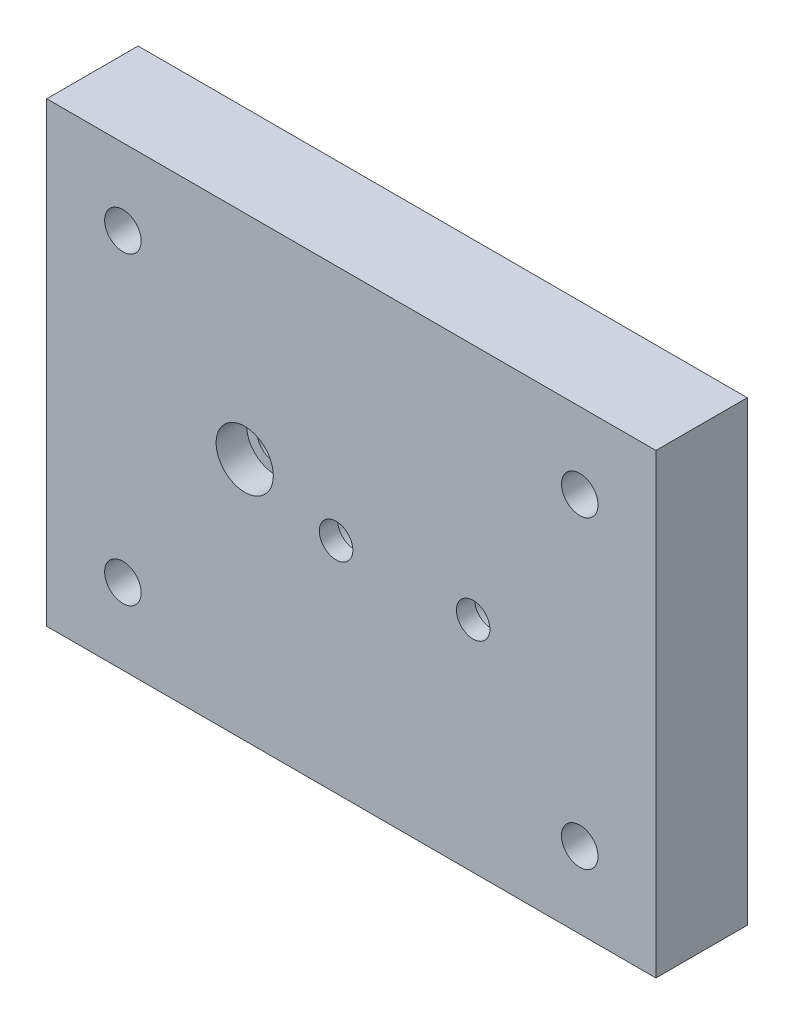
ISO-10303-21;
HEADER;
FILE_DESCRIPTION(('STEP AP214'),'2;1');
FILE_NAME('part.step','',(''),(''),'','','');
FILE_SCHEMA(('AUTOMOTIVE_DESIGN { 1 0 10303 214 1 1 1 1 }'));
ENDSEC;
DATA;
#1=APPLICATION_CONTEXT('core data for automotive mechanical design processes');
#2=APPLICATION_PROTOCOL_DEFINITION('international standard','automotive_design',2000,#1);
#3=PRODUCT_CONTEXT('',#1,'mechanical');
#4=PRODUCT('Part','Part','',(#3));
#5=PRODUCT_RELATED_PRODUCT_CATEGORY('part','',(#4));
#6=PRODUCT_DEFINITION_FORMATION('','',#4);
#7=PRODUCT_DEFINITION_CONTEXT('part definition',#1,'design');
#8=PRODUCT_DEFINITION('design','',#6,#7);
#9=PRODUCT_DEFINITION_SHAPE('','',#8);
#10=(LENGTH_UNIT() NAMED_UNIT(*) SI_UNIT(.MILLI.,.METRE.));
#11=(NAMED_UNIT(*) PLANE_ANGLE_UNIT() SI_UNIT($,.RADIAN.));
#12=(NAMED_UNIT(*) SI_UNIT($,.STERADIAN.) SOLID_ANGLE_UNIT());
#13=UNCERTAINTY_MEASURE_WITH_UNIT(LENGTH_MEASURE(1.E-05),#10,'distance_accuracy_value','');
#14=(GEOMETRIC_REPRESENTATION_CONTEXT(3) GLOBAL_UNCERTAINTY_ASSIGNED_CONTEXT((#13)) GLOBAL_UNIT_ASSIGNED_CONTEXT((#10,
#11,#12)) REPRESENTATION_CONTEXT('',''));
#15=CARTESIAN_POINT('',(0.,0.,0.));
#16=DIRECTION('',(0.,0.,1.));
#17=DIRECTION('',(1.,0.,0.));
#18=AXIS2_PLACEMENT_3D('',#15,#16,#17);
#19=CARTESIAN_POINT('',(0.,0.,30.));
#20=DIRECTION('',(1.,0.,0.));
#21=DIRECTION('',(0.,0.,-1.));
#22=AXIS2_PLACEMENT_3D('',#19,#20,#21);
#23=PLANE('',#22);
#24=DIRECTION('',(0.,-1.,0.));
#25=VECTOR('',#24,1.);
#26=CARTESIAN_POINT('',(0.,0.,0.));
#27=LINE('',#26,#25);
#28=CARTESIAN_POINT('',(0.,150.,0.));
#29=VERTEX_POINT('',#28);
#30=CARTESIAN_POINT('',(0.,0.,0.));
#31=VERTEX_POINT('',#30);
#32=EDGE_CURVE('E72',#29,#31,#27,.T.);
#33=ORIENTED_EDGE('',*,*,#32,.T.);
#34=DIRECTION('',(0.,0.,-1.));
#35=VECTOR('',#34,1.);
#36=CARTESIAN_POINT('',(0.,0.,30.));
#37=LINE('',#36,#35);
#38=CARTESIAN_POINT('',(0.,0.,30.));
#39=VERTEX_POINT('',#38);
#40=EDGE_CURVE('E11',#39,#31,#37,.T.);
#41=ORIENTED_EDGE('',*,*,#40,.F.);
#42=DIRECTION('',(0.,-1.,0.));
#43=VECTOR('',#42,1.);
#44=CARTESIAN_POINT('',(0.,0.,30.));
#45=LINE('',#44,#43);
#46=CARTESIAN_POINT('',(0.,150.,30.));
#47=VERTEX_POINT('',#46);
#48=EDGE_CURVE('E95',#47,#39,#45,.T.);
#49=ORIENTED_EDGE('',*,*,#48,.F.);
#50=DIRECTION('',(0.,0.,-1.));
#51=VECTOR('',#50,1.);
#52=CARTESIAN_POINT('',(0.,150.,30.));
#53=LINE('',#52,#51);
#54=EDGE_CURVE('E84',#47,#29,#53,.T.);
#55=ORIENTED_EDGE('',*,*,#54,.T.);
#56=EDGE_LOOP('',(#33,#41,#49,#55));
#57=FACE_BOUND('',#56,.T.);
#58=ADVANCED_FACE('F28',(#57),#23,.F.);
#59=CARTESIAN_POINT('',(0.,0.,30.));
#60=DIRECTION('',(0.,1.,0.));
#61=DIRECTION('',(0.,0.,1.));
#62=AXIS2_PLACEMENT_3D('',#59,#60,#61);
#63=PLANE('',#62);
#64=DIRECTION('',(1.,0.,0.));
#65=VECTOR('',#64,1.);
#66=CARTESIAN_POINT('',(0.,0.,0.));
#67=LINE('',#66,#65);
#68=CARTESIAN_POINT('',(200.,0.,0.));
#69=VERTEX_POINT('',#68);
#70=EDGE_CURVE('E68',#31,#69,#67,.T.);
#71=ORIENTED_EDGE('',*,*,#70,.T.);
#72=DIRECTION('',(0.,0.,-1.));
#73=VECTOR('',#72,1.);
#74=CARTESIAN_POINT('',(200.,0.,30.));
#75=LINE('',#74,#73);
#76=CARTESIAN_POINT('',(200.,0.,30.));
#77=VERTEX_POINT('',#76);
#78=EDGE_CURVE('E35',#77,#69,#75,.T.);
#79=ORIENTED_EDGE('',*,*,#78,.F.);
#80=DIRECTION('',(1.,0.,0.));
#81=VECTOR('',#80,1.);
#82=CARTESIAN_POINT('',(0.,0.,30.));
#83=LINE('',#82,#81);
#84=EDGE_CURVE('E80',#39,#77,#83,.T.);
#85=ORIENTED_EDGE('',*,*,#84,.F.);
#86=ORIENTED_EDGE('',*,*,#40,.T.);
#87=EDGE_LOOP('',(#71,#79,#85,#86));
#88=FACE_BOUND('',#87,.T.);
#89=ADVANCED_FACE('F79',(#88),#63,.F.);
#90=CARTESIAN_POINT('',(200.,0.,30.));
#91=DIRECTION('',(-1.,0.,0.));
#92=DIRECTION('',(0.,0.,1.));
#93=AXIS2_PLACEMENT_3D('',#90,#91,#92);
#94=PLANE('',#93);
#95=DIRECTION('',(0.,1.,0.));
#96=VECTOR('',#95,1.);
#97=CARTESIAN_POINT('',(200.,0.,0.));
#98=LINE('',#97,#96);
#99=CARTESIAN_POINT('',(200.,150.,0.));
#100=VERTEX_POINT('',#99);
#101=EDGE_CURVE('E73',#69,#100,#98,.T.);
#102=ORIENTED_EDGE('',*,*,#101,.T.);
#103=DIRECTION('',(0.,0.,-1.));
#104=VECTOR('',#103,1.);
#105=CARTESIAN_POINT('',(200.,150.,30.));
#106=LINE('',#105,#104);
#107=CARTESIAN_POINT('',(200.,150.,30.));
#108=VERTEX_POINT('',#107);
#109=EDGE_CURVE('E101',#108,#100,#106,.T.);
#110=ORIENTED_EDGE('',*,*,#109,.F.);
#111=DIRECTION('',(0.,1.,0.));
#112=VECTOR('',#111,1.);
#113=CARTESIAN_POINT('',(200.,0.,30.));
#114=LINE('',#113,#112);
#115=EDGE_CURVE('E47',#77,#108,#114,.T.);
#116=ORIENTED_EDGE('',*,*,#115,.F.);
#117=ORIENTED_EDGE('',*,*,#78,.T.);
#118=EDGE_LOOP('',(#102,#110,#116,#117));
#119=FACE_BOUND('',#118,.T.);
#120=ADVANCED_FACE('F104',(#119),#94,.F.);
#121=CARTESIAN_POINT('',(0.,150.,30.));
#122=DIRECTION('',(0.,-1.,0.));
#123=DIRECTION('',(0.,0.,-1.));
#124=AXIS2_PLACEMENT_3D('',#121,#122,#123);
#125=PLANE('',#124);
#126=DIRECTION('',(-1.,0.,0.));
#127=VECTOR('',#126,1.);
#128=CARTESIAN_POINT('',(0.,150.,0.));
#129=LINE('',#128,#127);
#130=EDGE_CURVE('E93',#100,#29,#129,.T.);
#131=ORIENTED_EDGE('',*,*,#130,.T.);
#132=ORIENTED_EDGE('',*,*,#54,.F.);
#133=DIRECTION('',(-1.,0.,0.));
#134=VECTOR('',#133,1.);
#135=CARTESIAN_POINT('',(0.,150.,30.));
#136=LINE('',#135,#134);
#137=EDGE_CURVE('E42',#108,#47,#136,.T.);
#138=ORIENTED_EDGE('',*,*,#137,.F.);
#139=ORIENTED_EDGE('',*,*,#109,.T.);
#140=EDGE_LOOP('',(#131,#132,#138,#139));
#141=FACE_BOUND('',#140,.T.);
#142=ADVANCED_FACE('F106',(#141),#125,.F.);
#143=CARTESIAN_POINT('',(0.,150.,30.));
#144=DIRECTION('',(0.,0.,-1.));
#145=DIRECTION('',(-1.,0.,0.));
#146=AXIS2_PLACEMENT_3D('',#143,#144,#145);
#147=PLANE('',#146);
#148=CARTESIAN_POINT('',(175.,125.,30.));
#149=DIRECTION('',(0.,0.,1.));
#150=DIRECTION('',(1.,0.,0.));
#151=AXIS2_PLACEMENT_3D('',#148,#149,#150);
#152=CIRCLE('',#151,6.00000000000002);
#153=CARTESIAN_POINT('',(181.,125.,30.));
#154=VERTEX_POINT('',#153);
#155=EDGE_CURVE('E419',#154,#154,#152,.T.);
#156=ORIENTED_EDGE('',*,*,#155,.F.);
#157=EDGE_LOOP('',(#156));
#158=FACE_BOUND('',#157,.T.);
#159=CARTESIAN_POINT('',(175.,25.,30.));
#160=DIRECTION('',(0.,0.,1.));
#161=DIRECTION('',(1.,0.,0.));
#162=AXIS2_PLACEMENT_3D('',#159,#160,#161);
#163=CIRCLE('',#162,6.00000000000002);
#164=CARTESIAN_POINT('',(181.,25.,30.));
#165=VERTEX_POINT('',#164);
#166=EDGE_CURVE('E422',#165,#165,#163,.T.);
#167=ORIENTED_EDGE('',*,*,#166,.F.);
#168=EDGE_LOOP('',(#167));
#169=FACE_BOUND('',#168,.T.);
#170=CARTESIAN_POINT('',(25.,25.,30.));
#171=DIRECTION('',(0.,0.,1.));
#172=DIRECTION('',(1.,0.,0.));
#173=AXIS2_PLACEMENT_3D('',#170,#171,#172);
#174=CIRCLE('',#173,6.);
#175=CARTESIAN_POINT('',(31.,25.,30.));
#176=VERTEX_POINT('',#175);
#177=EDGE_CURVE('E425',#176,#176,#174,.T.);
#178=ORIENTED_EDGE('',*,*,#177,.F.);
#179=EDGE_LOOP('',(#178));
#180=FACE_BOUND('',#179,.T.);
#181=CARTESIAN_POINT('',(25.,125.,30.));
#182=DIRECTION('',(0.,0.,1.));
#183=DIRECTION('',(1.,0.,0.));
#184=AXIS2_PLACEMENT_3D('',#181,#182,#183);
#185=CIRCLE('',#184,6.);
#186=CARTESIAN_POINT('',(31.,125.,30.));
#187=VERTEX_POINT('',#186);
#188=EDGE_CURVE('E428',#187,#187,#185,.T.);
#189=ORIENTED_EDGE('',*,*,#188,.F.);
#190=EDGE_LOOP('',(#189));
#191=FACE_BOUND('',#190,.T.);
#192=CARTESIAN_POINT('',(140.,71.88,30.));
#193=DIRECTION('',(0.,0.,1.));
#194=DIRECTION('',(1.,0.,0.));
#195=AXIS2_PLACEMENT_3D('',#192,#193,#194);
#196=CIRCLE('',#195,5.50000000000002);
#197=CARTESIAN_POINT('',(145.5,71.88,30.));
#198=VERTEX_POINT('',#197);
#199=EDGE_CURVE('E449',#198,#198,#196,.T.);
#200=ORIENTED_EDGE('',*,*,#199,.F.);
#201=EDGE_LOOP('',(#200));
#202=FACE_BOUND('',#201,.T.);
#203=CARTESIAN_POINT('',(95.,71.88,30.));
#204=DIRECTION('',(0.,0.,1.));
#205=DIRECTION('',(1.,0.,0.));
#206=AXIS2_PLACEMENT_3D('',#203,#204,#205);
#207=CIRCLE('',#206,5.5);
#208=CARTESIAN_POINT('',(100.5,71.88,30.));
#209=VERTEX_POINT('',#208);
#210=EDGE_CURVE('E452',#209,#209,#207,.T.);
#211=ORIENTED_EDGE('',*,*,#210,.F.);
#212=EDGE_LOOP('',(#211));
#213=FACE_BOUND('',#212,.T.);
#214=CARTESIAN_POINT('',(65.,80.,30.));
#215=DIRECTION('',(0.,0.,1.));
#216=DIRECTION('',(1.,0.,0.));
#217=AXIS2_PLACEMENT_3D('',#214,#215,#216);
#218=CIRCLE('',#217,9.38999999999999);
#219=CARTESIAN_POINT('',(74.39,80.,30.));
#220=VERTEX_POINT('',#219);
#221=EDGE_CURVE('E88',#220,#220,#218,.T.);
#222=ORIENTED_EDGE('',*,*,#221,.F.);
#223=EDGE_LOOP('',(#222));
#224=FACE_BOUND('',#223,.T.);
#225=ORIENTED_EDGE('',*,*,#48,.T.);
#226=ORIENTED_EDGE('',*,*,#84,.T.);
#227=ORIENTED_EDGE('',*,*,#115,.T.);
#228=ORIENTED_EDGE('',*,*,#137,.T.);
#229=EDGE_LOOP('',(#225,#226,#227,#228));
#230=FACE_BOUND('',#229,.T.);
#231=ADVANCED_FACE('F107',(#158,#169,#180,#191,#202,#213,#224,#230),#147,.F.);
#232=CARTESIAN_POINT('',(0.,150.,0.));
#233=DIRECTION('',(0.,0.,-1.));
#234=DIRECTION('',(-1.,0.,0.));
#235=AXIS2_PLACEMENT_3D('',#232,#233,#234);
#236=PLANE('',#235);
#237=CARTESIAN_POINT('',(25.,25.,0.));
#238=DIRECTION('',(0.,0.,1.));
#239=DIRECTION('',(1.,0.,0.));
#240=AXIS2_PLACEMENT_3D('',#237,#238,#239);
#241=CIRCLE('',#240,9.);
#242=CARTESIAN_POINT('',(34.,25.,0.));
#243=VERTEX_POINT('',#242);
#244=EDGE_CURVE('E382',#243,#243,#241,.T.);
#245=ORIENTED_EDGE('',*,*,#244,.T.);
#246=EDGE_LOOP('',(#245));
#247=FACE_BOUND('',#246,.T.);
#248=CARTESIAN_POINT('',(175.,25.,0.));
#249=DIRECTION('',(0.,0.,1.));
#250=DIRECTION('',(1.,0.,0.));
#251=AXIS2_PLACEMENT_3D('',#248,#249,#250);
#252=CIRCLE('',#251,9.00000000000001);
#253=CARTESIAN_POINT('',(184.,25.,0.));
#254=VERTEX_POINT('',#253);
#255=EDGE_CURVE('E395',#254,#254,#252,.T.);
#256=ORIENTED_EDGE('',*,*,#255,.T.);
#257=EDGE_LOOP('',(#256));
#258=FACE_BOUND('',#257,.T.);
#259=CARTESIAN_POINT('',(175.,125.,0.));
#260=DIRECTION('',(0.,0.,1.));
#261=DIRECTION('',(1.,0.,0.));
#262=AXIS2_PLACEMENT_3D('',#259,#260,#261);
#263=CIRCLE('',#262,9.00000000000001);
#264=CARTESIAN_POINT('',(184.,125.,0.));
#265=VERTEX_POINT('',#264);
#266=EDGE_CURVE('E404',#265,#265,#263,.T.);
#267=ORIENTED_EDGE('',*,*,#266,.T.);
#268=EDGE_LOOP('',(#267));
#269=FACE_BOUND('',#268,.T.);
#270=CARTESIAN_POINT('',(25.,125.,0.));
#271=DIRECTION('',(0.,0.,1.));
#272=DIRECTION('',(1.,0.,0.));
#273=AXIS2_PLACEMENT_3D('',#270,#271,#272);
#274=CIRCLE('',#273,9.00000000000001);
#275=CARTESIAN_POINT('',(34.,125.,0.));
#276=VERTEX_POINT('',#275);
#277=EDGE_CURVE('E413',#276,#276,#274,.T.);
#278=ORIENTED_EDGE('',*,*,#277,.T.);
#279=EDGE_LOOP('',(#278));
#280=FACE_BOUND('',#279,.T.);
#281=CARTESIAN_POINT('',(95.,71.88,0.));
#282=DIRECTION('',(0.,0.,1.));
#283=DIRECTION('',(1.,0.,0.));
#284=AXIS2_PLACEMENT_3D('',#281,#282,#283);
#285=CIRCLE('',#284,9.99999999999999);
#286=CARTESIAN_POINT('',(105.,71.88,0.));
#287=VERTEX_POINT('',#286);
#288=EDGE_CURVE('E434',#287,#287,#285,.T.);
#289=ORIENTED_EDGE('',*,*,#288,.T.);
#290=EDGE_LOOP('',(#289));
#291=FACE_BOUND('',#290,.T.);
#292=CARTESIAN_POINT('',(140.,71.88,0.));
#293=DIRECTION('',(0.,0.,1.));
#294=DIRECTION('',(1.,0.,0.));
#295=AXIS2_PLACEMENT_3D('',#292,#293,#294);
#296=CIRCLE('',#295,10.);
#297=CARTESIAN_POINT('',(150.,71.88,0.));
#298=VERTEX_POINT('',#297);
#299=EDGE_CURVE('E443',#298,#298,#296,.T.);
#300=ORIENTED_EDGE('',*,*,#299,.T.);
#301=EDGE_LOOP('',(#300));
#302=FACE_BOUND('',#301,.T.);
#303=CARTESIAN_POINT('',(65.,80.,0.));
#304=DIRECTION('',(0.,0.,1.));
#305=DIRECTION('',(1.,0.,0.));
#306=AXIS2_PLACEMENT_3D('',#303,#304,#305);
#307=CIRCLE('',#306,9.00000000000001);
#308=CARTESIAN_POINT('',(74.,80.,0.));
#309=VERTEX_POINT('',#308);
#310=EDGE_CURVE('E458',#309,#309,#307,.T.);
#311=ORIENTED_EDGE('',*,*,#310,.T.);
#312=EDGE_LOOP('',(#311));
#313=FACE_BOUND('',#312,.T.);
#314=ORIENTED_EDGE('',*,*,#32,.F.);
#315=ORIENTED_EDGE('',*,*,#130,.F.);
#316=ORIENTED_EDGE('',*,*,#101,.F.);
#317=ORIENTED_EDGE('',*,*,#70,.F.);
#318=EDGE_LOOP('',(#314,#315,#316,#317));
#319=FACE_BOUND('',#318,.T.);
#320=ADVANCED_FACE('F69',(#247,#258,#269,#280,#291,#302,#313,#319),#236,.T.);
#321=CARTESIAN_POINT('',(65.,80.,20.));
#322=DIRECTION('',(0.,0.,1.));
#323=DIRECTION('',(1.,0.,0.));
#324=AXIS2_PLACEMENT_3D('',#321,#322,#323);
#325=CYLINDRICAL_SURFACE('',#324,9.38999999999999);
#326=CARTESIAN_POINT('',(65.,80.,20.));
#327=DIRECTION('',(0.,0.,1.));
#328=DIRECTION('',(1.,0.,0.));
#329=AXIS2_PLACEMENT_3D('',#326,#327,#328);
#330=CIRCLE('',#329,9.38999999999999);
#331=CARTESIAN_POINT('',(74.39,80.,20.));
#332=VERTEX_POINT('',#331);
#333=EDGE_CURVE('E85',#332,#332,#330,.T.);
#334=ORIENTED_EDGE('',*,*,#333,.F.);
#335=EDGE_LOOP('',(#334));
#336=FACE_BOUND('',#335,.T.);
#337=ORIENTED_EDGE('',*,*,#221,.T.);
#338=EDGE_LOOP('',(#337));
#339=FACE_BOUND('',#338,.T.);
#340=ADVANCED_FACE('F115',(#336,#339),#325,.F.);
#341=CARTESIAN_POINT('',(65.,80.,20.));
#342=DIRECTION('',(0.,0.,1.));
#343=DIRECTION('',(1.,0.,0.));
#344=AXIS2_PLACEMENT_3D('',#341,#342,#343);
#345=PLANE('',#344);
#346=CARTESIAN_POINT('',(65.,80.,20.));
#347=DIRECTION('',(0.,0.,1.));
#348=DIRECTION('',(1.,0.,0.));
#349=AXIS2_PLACEMENT_3D('',#346,#347,#348);
#350=CIRCLE('',#349,6.);
#351=CARTESIAN_POINT('',(71.,80.,20.));
#352=VERTEX_POINT('',#351);
#353=EDGE_CURVE('E464',#352,#352,#350,.T.);
#354=ORIENTED_EDGE('',*,*,#353,.F.);
#355=EDGE_LOOP('',(#354));
#356=FACE_BOUND('',#355,.T.);
#357=ORIENTED_EDGE('',*,*,#333,.T.);
#358=EDGE_LOOP('',(#357));
#359=FACE_BOUND('',#358,.T.);
#360=ADVANCED_FACE('F155',(#356,#359),#345,.T.);
#361=CARTESIAN_POINT('',(65.,80.,13.));
#362=DIRECTION('',(0.,0.,1.));
#363=DIRECTION('',(1.,0.,0.));
#364=AXIS2_PLACEMENT_3D('',#361,#362,#363);
#365=CYLINDRICAL_SURFACE('',#364,6.);
#366=CARTESIAN_POINT('',(65.,80.,13.));
#367=DIRECTION('',(0.,0.,1.));
#368=DIRECTION('',(1.,0.,0.));
#369=AXIS2_PLACEMENT_3D('',#366,#367,#368);
#370=CIRCLE('',#369,6.);
#371=CARTESIAN_POINT('',(71.,80.,13.));
#372=VERTEX_POINT('',#371);
#373=EDGE_CURVE('E461',#372,#372,#370,.F.);
#374=ORIENTED_EDGE('',*,*,#373,.T.);
#375=EDGE_LOOP('',(#374));
#376=FACE_BOUND('',#375,.T.);
#377=ORIENTED_EDGE('',*,*,#353,.T.);
#378=EDGE_LOOP('',(#377));
#379=FACE_BOUND('',#378,.T.);
#380=ADVANCED_FACE('F165',(#376,#379),#365,.F.);
#381=CARTESIAN_POINT('',(65.,80.,13.));
#382=DIRECTION('',(0.,0.,1.));
#383=DIRECTION('',(1.,0.,0.));
#384=AXIS2_PLACEMENT_3D('',#381,#382,#383);
#385=PLANE('',#384);
#386=CARTESIAN_POINT('',(65.,80.,13.));
#387=DIRECTION('',(0.,0.,1.));
#388=DIRECTION('',(1.,0.,0.));
#389=AXIS2_PLACEMENT_3D('',#386,#387,#388);
#390=CIRCLE('',#389,9.00000000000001);
#391=CARTESIAN_POINT('',(74.,80.,13.));
#392=VERTEX_POINT('',#391);
#393=EDGE_CURVE('E455',#392,#392,#390,.T.);
#394=ORIENTED_EDGE('',*,*,#393,.F.);
#395=EDGE_LOOP('',(#394));
#396=FACE_BOUND('',#395,.T.);
#397=ORIENTED_EDGE('',*,*,#373,.F.);
#398=EDGE_LOOP('',(#397));
#399=FACE_BOUND('',#398,.T.);
#400=ADVANCED_FACE('F175',(#396,#399),#385,.F.);
#401=CARTESIAN_POINT('',(65.,80.,0.));
#402=DIRECTION('',(0.,0.,1.));
#403=DIRECTION('',(1.,0.,0.));
#404=AXIS2_PLACEMENT_3D('',#401,#402,#403);
#405=CYLINDRICAL_SURFACE('',#404,9.00000000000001);
#406=ORIENTED_EDGE('',*,*,#310,.F.);
#407=EDGE_LOOP('',(#406));
#408=FACE_BOUND('',#407,.T.);
#409=ORIENTED_EDGE('',*,*,#393,.T.);
#410=EDGE_LOOP('',(#409));
#411=FACE_BOUND('',#410,.T.);
#412=ADVANCED_FACE('F185',(#408,#411),#405,.F.);
#413=CARTESIAN_POINT('',(95.,71.88,24.));
#414=DIRECTION('',(0.,0.,1.));
#415=DIRECTION('',(1.,0.,0.));
#416=AXIS2_PLACEMENT_3D('',#413,#414,#415);
#417=CYLINDRICAL_SURFACE('',#416,5.5);
#418=CARTESIAN_POINT('',(95.,71.88,24.));
#419=DIRECTION('',(0.,0.,1.));
#420=DIRECTION('',(1.,0.,0.));
#421=AXIS2_PLACEMENT_3D('',#418,#419,#420);
#422=CIRCLE('',#421,5.5);
#423=CARTESIAN_POINT('',(100.5,71.88,24.));
#424=VERTEX_POINT('',#423);
#425=EDGE_CURVE('E437',#424,#424,#422,.F.);
#426=ORIENTED_EDGE('',*,*,#425,.T.);
#427=EDGE_LOOP('',(#426));
#428=FACE_BOUND('',#427,.T.);
#429=ORIENTED_EDGE('',*,*,#210,.T.);
#430=EDGE_LOOP('',(#429));
#431=FACE_BOUND('',#430,.T.);
#432=ADVANCED_FACE('F195',(#428,#431),#417,.F.);
#433=CARTESIAN_POINT('',(140.,71.88,24.));
#434=DIRECTION('',(0.,0.,1.));
#435=DIRECTION('',(1.,0.,0.));
#436=AXIS2_PLACEMENT_3D('',#433,#434,#435);
#437=CYLINDRICAL_SURFACE('',#436,5.50000000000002);
#438=CARTESIAN_POINT('',(140.,71.88,24.));
#439=DIRECTION('',(0.,0.,1.));
#440=DIRECTION('',(1.,0.,0.));
#441=AXIS2_PLACEMENT_3D('',#438,#439,#440);
#442=CIRCLE('',#441,5.50000000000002);
#443=CARTESIAN_POINT('',(145.5,71.88,24.));
#444=VERTEX_POINT('',#443);
#445=EDGE_CURVE('E446',#444,#444,#442,.F.);
#446=ORIENTED_EDGE('',*,*,#445,.T.);
#447=EDGE_LOOP('',(#446));
#448=FACE_BOUND('',#447,.T.);
#449=ORIENTED_EDGE('',*,*,#199,.T.);
#450=EDGE_LOOP('',(#449));
#451=FACE_BOUND('',#450,.T.);
#452=ADVANCED_FACE('F205',(#448,#451),#437,.F.);
#453=CARTESIAN_POINT('',(140.,71.88,24.));
#454=DIRECTION('',(0.,0.,1.));
#455=DIRECTION('',(1.,0.,0.));
#456=AXIS2_PLACEMENT_3D('',#453,#454,#455);
#457=PLANE('',#456);
#458=CARTESIAN_POINT('',(140.,71.88,24.));
#459=DIRECTION('',(0.,0.,1.));
#460=DIRECTION('',(1.,0.,0.));
#461=AXIS2_PLACEMENT_3D('',#458,#459,#460);
#462=CIRCLE('',#461,10.);
#463=CARTESIAN_POINT('',(150.,71.88,24.));
#464=VERTEX_POINT('',#463);
#465=EDGE_CURVE('E440',#464,#464,#462,.T.);
#466=ORIENTED_EDGE('',*,*,#465,.F.);
#467=EDGE_LOOP('',(#466));
#468=FACE_BOUND('',#467,.T.);
#469=ORIENTED_EDGE('',*,*,#445,.F.);
#470=EDGE_LOOP('',(#469));
#471=FACE_BOUND('',#470,.T.);
#472=ADVANCED_FACE('F215',(#468,#471),#457,.F.);
#473=CARTESIAN_POINT('',(140.,71.88,0.));
#474=DIRECTION('',(0.,0.,1.));
#475=DIRECTION('',(1.,0.,0.));
#476=AXIS2_PLACEMENT_3D('',#473,#474,#475);
#477=CYLINDRICAL_SURFACE('',#476,10.);
#478=ORIENTED_EDGE('',*,*,#299,.F.);
#479=EDGE_LOOP('',(#478));
#480=FACE_BOUND('',#479,.T.);
#481=ORIENTED_EDGE('',*,*,#465,.T.);
#482=EDGE_LOOP('',(#481));
#483=FACE_BOUND('',#482,.T.);
#484=ADVANCED_FACE('F225',(#480,#483),#477,.F.);
#485=CARTESIAN_POINT('',(95.,71.88,24.));
#486=DIRECTION('',(0.,0.,1.));
#487=DIRECTION('',(1.,0.,0.));
#488=AXIS2_PLACEMENT_3D('',#485,#486,#487);
#489=PLANE('',#488);
#490=CARTESIAN_POINT('',(95.,71.88,24.));
#491=DIRECTION('',(0.,0.,1.));
#492=DIRECTION('',(1.,0.,0.));
#493=AXIS2_PLACEMENT_3D('',#490,#491,#492);
#494=CIRCLE('',#493,9.99999999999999);
#495=CARTESIAN_POINT('',(105.,71.88,24.));
#496=VERTEX_POINT('',#495);
#497=EDGE_CURVE('E431',#496,#496,#494,.T.);
#498=ORIENTED_EDGE('',*,*,#497,.F.);
#499=EDGE_LOOP('',(#498));
#500=FACE_BOUND('',#499,.T.);
#501=ORIENTED_EDGE('',*,*,#425,.F.);
#502=EDGE_LOOP('',(#501));
#503=FACE_BOUND('',#502,.T.);
#504=ADVANCED_FACE('F235',(#500,#503),#489,.F.);
#505=CARTESIAN_POINT('',(95.,71.88,0.));
#506=DIRECTION('',(0.,0.,1.));
#507=DIRECTION('',(1.,0.,0.));
#508=AXIS2_PLACEMENT_3D('',#505,#506,#507);
#509=CYLINDRICAL_SURFACE('',#508,9.99999999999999);
#510=ORIENTED_EDGE('',*,*,#288,.F.);
#511=EDGE_LOOP('',(#510));
#512=FACE_BOUND('',#511,.T.);
#513=ORIENTED_EDGE('',*,*,#497,.T.);
#514=EDGE_LOOP('',(#513));
#515=FACE_BOUND('',#514,.T.);
#516=ADVANCED_FACE('F245',(#512,#515),#509,.F.);
#517=CARTESIAN_POINT('',(25.,125.,12.));
#518=DIRECTION('',(0.,0.,1.));
#519=DIRECTION('',(1.,0.,0.));
#520=AXIS2_PLACEMENT_3D('',#517,#518,#519);
#521=CYLINDRICAL_SURFACE('',#520,6.);
#522=CARTESIAN_POINT('',(25.,125.,12.));
#523=DIRECTION('',(0.,0.,1.));
#524=DIRECTION('',(1.,0.,0.));
#525=AXIS2_PLACEMENT_3D('',#522,#523,#524);
#526=CIRCLE('',#525,6.);
#527=CARTESIAN_POINT('',(31.,125.,12.));
#528=VERTEX_POINT('',#527);
#529=EDGE_CURVE('E416',#528,#528,#526,.F.);
#530=ORIENTED_EDGE('',*,*,#529,.T.);
#531=EDGE_LOOP('',(#530));
#532=FACE_BOUND('',#531,.T.);
#533=ORIENTED_EDGE('',*,*,#188,.T.);
#534=EDGE_LOOP('',(#533));
#535=FACE_BOUND('',#534,.T.);
#536=ADVANCED_FACE('F255',(#532,#535),#521,.F.);
#537=CARTESIAN_POINT('',(25.,25.,12.));
#538=DIRECTION('',(0.,0.,1.));
#539=DIRECTION('',(1.,0.,0.));
#540=AXIS2_PLACEMENT_3D('',#537,#538,#539);
#541=CYLINDRICAL_SURFACE('',#540,6.);
#542=CARTESIAN_POINT('',(25.,25.,12.));
#543=DIRECTION('',(0.,0.,1.));
#544=DIRECTION('',(1.,0.,0.));
#545=AXIS2_PLACEMENT_3D('',#542,#543,#544);
#546=CIRCLE('',#545,6.);
#547=CARTESIAN_POINT('',(31.,25.,12.));
#548=VERTEX_POINT('',#547);
#549=EDGE_CURVE('E387',#548,#548,#546,.F.);
#550=ORIENTED_EDGE('',*,*,#549,.T.);
#551=EDGE_LOOP('',(#550));
#552=FACE_BOUND('',#551,.T.);
#553=ORIENTED_EDGE('',*,*,#177,.T.);
#554=EDGE_LOOP('',(#553));
#555=FACE_BOUND('',#554,.T.);
#556=ADVANCED_FACE('F265',(#552,#555),#541,.F.);
#557=CARTESIAN_POINT('',(175.,25.,12.));
#558=DIRECTION('',(0.,0.,1.));
#559=DIRECTION('',(1.,0.,0.));
#560=AXIS2_PLACEMENT_3D('',#557,#558,#559);
#561=CYLINDRICAL_SURFACE('',#560,6.00000000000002);
#562=CARTESIAN_POINT('',(175.,25.,12.));
#563=DIRECTION('',(0.,0.,1.));
#564=DIRECTION('',(1.,0.,0.));
#565=AXIS2_PLACEMENT_3D('',#562,#563,#564);
#566=CIRCLE('',#565,6.00000000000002);
#567=CARTESIAN_POINT('',(181.,25.,12.));
#568=VERTEX_POINT('',#567);
#569=EDGE_CURVE('E398',#568,#568,#566,.F.);
#570=ORIENTED_EDGE('',*,*,#569,.T.);
#571=EDGE_LOOP('',(#570));
#572=FACE_BOUND('',#571,.T.);
#573=ORIENTED_EDGE('',*,*,#166,.T.);
#574=EDGE_LOOP('',(#573));
#575=FACE_BOUND('',#574,.T.);
#576=ADVANCED_FACE('F275',(#572,#575),#561,.F.);
#577=CARTESIAN_POINT('',(175.,125.,12.));
#578=DIRECTION('',(0.,0.,1.));
#579=DIRECTION('',(1.,0.,0.));
#580=AXIS2_PLACEMENT_3D('',#577,#578,#579);
#581=CYLINDRICAL_SURFACE('',#580,6.00000000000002);
#582=CARTESIAN_POINT('',(175.,125.,12.));
#583=DIRECTION('',(0.,0.,1.));
#584=DIRECTION('',(1.,0.,0.));
#585=AXIS2_PLACEMENT_3D('',#582,#583,#584);
#586=CIRCLE('',#585,6.00000000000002);
#587=CARTESIAN_POINT('',(181.,125.,12.));
#588=VERTEX_POINT('',#587);
#589=EDGE_CURVE('E407',#588,#588,#586,.F.);
#590=ORIENTED_EDGE('',*,*,#589,.T.);
#591=EDGE_LOOP('',(#590));
#592=FACE_BOUND('',#591,.T.);
#593=ORIENTED_EDGE('',*,*,#155,.T.);
#594=EDGE_LOOP('',(#593));
#595=FACE_BOUND('',#594,.T.);
#596=ADVANCED_FACE('F285',(#592,#595),#581,.F.);
#597=CARTESIAN_POINT('',(25.,125.,12.));
#598=DIRECTION('',(0.,0.,1.));
#599=DIRECTION('',(1.,0.,0.));
#600=AXIS2_PLACEMENT_3D('',#597,#598,#599);
#601=PLANE('',#600);
#602=CARTESIAN_POINT('',(25.,125.,12.));
#603=DIRECTION('',(0.,0.,1.));
#604=DIRECTION('',(1.,0.,0.));
#605=AXIS2_PLACEMENT_3D('',#602,#603,#604);
#606=CIRCLE('',#605,9.00000000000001);
#607=CARTESIAN_POINT('',(34.,125.,12.));
#608=VERTEX_POINT('',#607);
#609=EDGE_CURVE('E410',#608,#608,#606,.T.);
#610=ORIENTED_EDGE('',*,*,#609,.F.);
#611=EDGE_LOOP('',(#610));
#612=FACE_BOUND('',#611,.T.);
#613=ORIENTED_EDGE('',*,*,#529,.F.);
#614=EDGE_LOOP('',(#613));
#615=FACE_BOUND('',#614,.T.);
#616=ADVANCED_FACE('F295',(#612,#615),#601,.F.);
#617=CARTESIAN_POINT('',(25.,125.,0.));
#618=DIRECTION('',(0.,0.,1.));
#619=DIRECTION('',(1.,0.,0.));
#620=AXIS2_PLACEMENT_3D('',#617,#618,#619);
#621=CYLINDRICAL_SURFACE('',#620,9.00000000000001);
#622=ORIENTED_EDGE('',*,*,#277,.F.);
#623=EDGE_LOOP('',(#622));
#624=FACE_BOUND('',#623,.T.);
#625=ORIENTED_EDGE('',*,*,#609,.T.);
#626=EDGE_LOOP('',(#625));
#627=FACE_BOUND('',#626,.T.);
#628=ADVANCED_FACE('F305',(#624,#627),#621,.F.);
#629=CARTESIAN_POINT('',(175.,125.,12.));
#630=DIRECTION('',(0.,0.,1.));
#631=DIRECTION('',(1.,0.,0.));
#632=AXIS2_PLACEMENT_3D('',#629,#630,#631);
#633=PLANE('',#632);
#634=CARTESIAN_POINT('',(175.,125.,12.));
#635=DIRECTION('',(0.,0.,1.));
#636=DIRECTION('',(1.,0.,0.));
#637=AXIS2_PLACEMENT_3D('',#634,#635,#636);
#638=CIRCLE('',#637,9.00000000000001);
#639=CARTESIAN_POINT('',(184.,125.,12.));
#640=VERTEX_POINT('',#639);
#641=EDGE_CURVE('E401',#640,#640,#638,.T.);
#642=ORIENTED_EDGE('',*,*,#641,.F.);
#643=EDGE_LOOP('',(#642));
#644=FACE_BOUND('',#643,.T.);
#645=ORIENTED_EDGE('',*,*,#589,.F.);
#646=EDGE_LOOP('',(#645));
#647=FACE_BOUND('',#646,.T.);
#648=ADVANCED_FACE('F315',(#644,#647),#633,.F.);
#649=CARTESIAN_POINT('',(175.,125.,0.));
#650=DIRECTION('',(0.,0.,1.));
#651=DIRECTION('',(1.,0.,0.));
#652=AXIS2_PLACEMENT_3D('',#649,#650,#651);
#653=CYLINDRICAL_SURFACE('',#652,9.00000000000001);
#654=ORIENTED_EDGE('',*,*,#266,.F.);
#655=EDGE_LOOP('',(#654));
#656=FACE_BOUND('',#655,.T.);
#657=ORIENTED_EDGE('',*,*,#641,.T.);
#658=EDGE_LOOP('',(#657));
#659=FACE_BOUND('',#658,.T.);
#660=ADVANCED_FACE('F325',(#656,#659),#653,.F.);
#661=CARTESIAN_POINT('',(175.,25.,12.));
#662=DIRECTION('',(0.,0.,1.));
#663=DIRECTION('',(1.,0.,0.));
#664=AXIS2_PLACEMENT_3D('',#661,#662,#663);
#665=PLANE('',#664);
#666=CARTESIAN_POINT('',(175.,25.,12.));
#667=DIRECTION('',(0.,0.,1.));
#668=DIRECTION('',(1.,0.,0.));
#669=AXIS2_PLACEMENT_3D('',#666,#667,#668);
#670=CIRCLE('',#669,9.00000000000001);
#671=CARTESIAN_POINT('',(184.,25.,12.));
#672=VERTEX_POINT('',#671);
#673=EDGE_CURVE('E392',#672,#672,#670,.T.);
#674=ORIENTED_EDGE('',*,*,#673,.F.);
#675=EDGE_LOOP('',(#674));
#676=FACE_BOUND('',#675,.T.);
#677=ORIENTED_EDGE('',*,*,#569,.F.);
#678=EDGE_LOOP('',(#677));
#679=FACE_BOUND('',#678,.T.);
#680=ADVANCED_FACE('F335',(#676,#679),#665,.F.);
#681=CARTESIAN_POINT('',(175.,25.,0.));
#682=DIRECTION('',(0.,0.,1.));
#683=DIRECTION('',(1.,0.,0.));
#684=AXIS2_PLACEMENT_3D('',#681,#682,#683);
#685=CYLINDRICAL_SURFACE('',#684,9.00000000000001);
#686=ORIENTED_EDGE('',*,*,#255,.F.);
#687=EDGE_LOOP('',(#686));
#688=FACE_BOUND('',#687,.T.);
#689=ORIENTED_EDGE('',*,*,#673,.T.);
#690=EDGE_LOOP('',(#689));
#691=FACE_BOUND('',#690,.T.);
#692=ADVANCED_FACE('F345',(#688,#691),#685,.F.);
#693=CARTESIAN_POINT('',(25.,25.,12.));
#694=DIRECTION('',(0.,0.,1.));
#695=DIRECTION('',(1.,0.,0.));
#696=AXIS2_PLACEMENT_3D('',#693,#694,#695);
#697=PLANE('',#696);
#698=CARTESIAN_POINT('',(25.,25.,12.));
#699=DIRECTION('',(0.,0.,1.));
#700=DIRECTION('',(1.,0.,0.));
#701=AXIS2_PLACEMENT_3D('',#698,#699,#700);
#702=CIRCLE('',#701,9.);
#703=CARTESIAN_POINT('',(34.,25.,12.));
#704=VERTEX_POINT('',#703);
#705=EDGE_CURVE('E385',#704,#704,#702,.T.);
#706=ORIENTED_EDGE('',*,*,#705,.F.);
#707=EDGE_LOOP('',(#706));
#708=FACE_BOUND('',#707,.T.);
#709=ORIENTED_EDGE('',*,*,#549,.F.);
#710=EDGE_LOOP('',(#709));
#711=FACE_BOUND('',#710,.T.);
#712=ADVANCED_FACE('F355',(#708,#711),#697,.F.);
#713=CARTESIAN_POINT('',(25.,25.,0.));
#714=DIRECTION('',(0.,0.,1.));
#715=DIRECTION('',(1.,0.,0.));
#716=AXIS2_PLACEMENT_3D('',#713,#714,#715);
#717=CYLINDRICAL_SURFACE('',#716,9.);
#718=ORIENTED_EDGE('',*,*,#244,.F.);
#719=EDGE_LOOP('',(#718));
#720=FACE_BOUND('',#719,.T.);
#721=ORIENTED_EDGE('',*,*,#705,.T.);
#722=EDGE_LOOP('',(#721));
#723=FACE_BOUND('',#722,.T.);
#724=ADVANCED_FACE('F365',(#720,#723),#717,.F.);
#725=CLOSED_SHELL('',(#58,#89,#120,#142,#231,#320,#340,#360,#380,#400,#412,#432,#452,#472,#484,
#504,#516,#536,#556,#576,#596,#616,#628,#648,#660,#680,#692,#712,#724));
#726=MANIFOLD_SOLID_BREP('B2',#725);
#727=ADVANCED_BREP_SHAPE_REPRESENTATION('',(#18,#726),#14);
#728=SHAPE_DEFINITION_REPRESENTATION(#9,#727);
ENDSEC;
END-ISO-10303-21;
